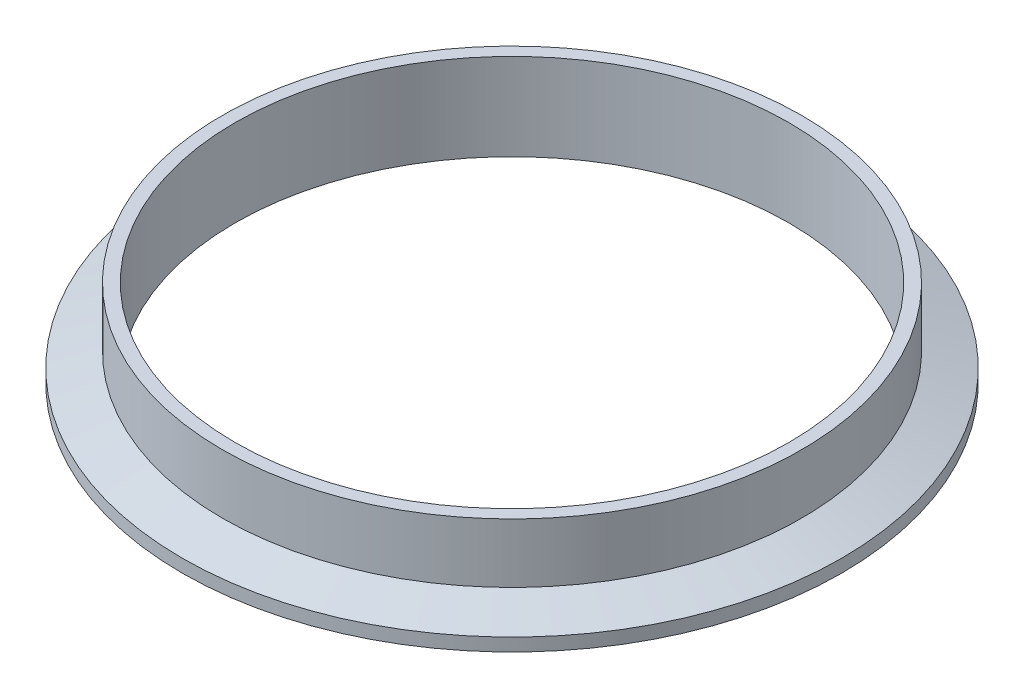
ISO-10303-21;
HEADER;
FILE_DESCRIPTION(('STEP AP214'),'2;1');
FILE_NAME('part.step','',(''),(''),'','','');
FILE_SCHEMA(('AUTOMOTIVE_DESIGN { 1 0 10303 214 1 1 1 1 }'));
ENDSEC;
DATA;
#1=APPLICATION_CONTEXT('core data for automotive mechanical design processes');
#2=APPLICATION_PROTOCOL_DEFINITION('international standard','automotive_design',2000,#1);
#3=PRODUCT_CONTEXT('',#1,'mechanical');
#4=PRODUCT('Part','Part','',(#3));
#5=PRODUCT_RELATED_PRODUCT_CATEGORY('part','',(#4));
#6=PRODUCT_DEFINITION_FORMATION('','',#4);
#7=PRODUCT_DEFINITION_CONTEXT('part definition',#1,'design');
#8=PRODUCT_DEFINITION('design','',#6,#7);
#9=PRODUCT_DEFINITION_SHAPE('','',#8);
#10=(LENGTH_UNIT() NAMED_UNIT(*) SI_UNIT(.MILLI.,.METRE.));
#11=(NAMED_UNIT(*) PLANE_ANGLE_UNIT() SI_UNIT($,.RADIAN.));
#12=(NAMED_UNIT(*) SI_UNIT($,.STERADIAN.) SOLID_ANGLE_UNIT());
#13=UNCERTAINTY_MEASURE_WITH_UNIT(LENGTH_MEASURE(1.E-05),#10,'distance_accuracy_value','');
#14=(GEOMETRIC_REPRESENTATION_CONTEXT(3) GLOBAL_UNCERTAINTY_ASSIGNED_CONTEXT((#13)) GLOBAL_UNIT_ASSIGNED_CONTEXT((#10,
#11,#12)) REPRESENTATION_CONTEXT('',''));
#15=CARTESIAN_POINT('',(0.,0.,0.));
#16=DIRECTION('',(0.,0.,1.));
#17=DIRECTION('',(1.,0.,0.));
#18=AXIS2_PLACEMENT_3D('',#15,#16,#17);
#19=CARTESIAN_POINT('',(0.,0.787399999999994,0.));
#20=DIRECTION('',(0.,-1.,0.));
#21=DIRECTION('',(0.,0.,-1.));
#22=AXIS2_PLACEMENT_3D('',#19,#20,#21);
#23=TOROIDAL_SURFACE('',#22,69.2804084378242,0.787400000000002);
#24=CARTESIAN_POINT('',(0.,0.,0.));
#25=DIRECTION('',(0.,-1.,0.));
#26=DIRECTION('',(0.,0.,-1.));
#27=AXIS2_PLACEMENT_3D('',#24,#25,#26);
#28=CIRCLE('',#27,69.2804084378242);
#29=CARTESIAN_POINT('',(0.,0.,-69.2804084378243));
#30=VERTEX_POINT('',#29);
#31=EDGE_CURVE('E62',#30,#30,#28,.T.);
#32=ORIENTED_EDGE('',*,*,#31,.T.);
#33=EDGE_LOOP('',(#32));
#34=FACE_BOUND('',#33,.T.);
#35=CARTESIAN_POINT('',(0.,0.474458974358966,0.));
#36=DIRECTION('',(0.,-1.,0.));
#37=DIRECTION('',(0.,0.,-1.));
#38=AXIS2_PLACEMENT_3D('',#35,#36,#37);
#39=CIRCLE('',#38,68.5578666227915);
#40=CARTESIAN_POINT('',(0.,0.474458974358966,-68.5578666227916));
#41=VERTEX_POINT('',#40);
#42=EDGE_CURVE('E10',#41,#41,#39,.T.);
#43=ORIENTED_EDGE('',*,*,#42,.F.);
#44=EDGE_LOOP('',(#43));
#45=FACE_BOUND('',#44,.T.);
#46=ADVANCED_FACE('F28',(#34,#45),#23,.T.);
#47=CARTESIAN_POINT('',(0.,0.,0.));
#48=DIRECTION('',(0.,-1.,0.));
#49=DIRECTION('',(0.,0.,-1.));
#50=AXIS2_PLACEMENT_3D('',#47,#48,#49);
#51=TOROIDAL_SURFACE('',#50,67.4624,1.19380000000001);
#52=CARTESIAN_POINT('',(0.,0.474458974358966,0.));
#53=DIRECTION('',(0.,-1.,0.));
#54=DIRECTION('',(0.,0.,-1.));
#55=AXIS2_PLACEMENT_3D('',#52,#53,#54);
#56=CIRCLE('',#55,66.3669333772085);
#57=CARTESIAN_POINT('',(0.,0.474458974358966,-66.3669333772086));
#58=VERTEX_POINT('',#57);
#59=EDGE_CURVE('E34',#58,#58,#56,.T.);
#60=ORIENTED_EDGE('',*,*,#59,.F.);
#61=EDGE_LOOP('',(#60));
#62=FACE_BOUND('',#61,.T.);
#63=ORIENTED_EDGE('',*,*,#42,.T.);
#64=EDGE_LOOP('',(#63));
#65=FACE_BOUND('',#64,.T.);
#66=ADVANCED_FACE('F110',(#62,#65),#51,.F.);
#67=CARTESIAN_POINT('',(0.,0.787399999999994,0.));
#68=DIRECTION('',(0.,-1.,0.));
#69=DIRECTION('',(0.,0.,-1.));
#70=AXIS2_PLACEMENT_3D('',#67,#68,#69);
#71=TOROIDAL_SURFACE('',#70,65.6443915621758,0.78739999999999);
#72=ORIENTED_EDGE('',*,*,#59,.T.);
#73=EDGE_LOOP('',(#72));
#74=FACE_BOUND('',#73,.T.);
#75=CARTESIAN_POINT('',(0.,0.,0.));
#76=DIRECTION('',(0.,-1.,0.));
#77=DIRECTION('',(0.,0.,-1.));
#78=AXIS2_PLACEMENT_3D('',#75,#76,#77);
#79=CIRCLE('',#78,65.6443915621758);
#80=CARTESIAN_POINT('',(0.,0.,-65.6443915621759));
#81=VERTEX_POINT('',#80);
#82=EDGE_CURVE('E38',#81,#81,#79,.T.);
#83=ORIENTED_EDGE('',*,*,#82,.F.);
#84=EDGE_LOOP('',(#83));
#85=FACE_BOUND('',#84,.T.);
#86=ADVANCED_FACE('F106',(#74,#85),#71,.T.);
#87=CARTESIAN_POINT('',(0.,0.,0.));
#88=DIRECTION('',(0.,1.,0.));
#89=DIRECTION('',(0.,0.,1.));
#90=AXIS2_PLACEMENT_3D('',#87,#88,#89);
#91=PLANE('',#90);
#92=CARTESIAN_POINT('',(0.,0.,0.));
#93=DIRECTION('',(0.,-1.,0.));
#94=DIRECTION('',(0.,0.,-1.));
#95=AXIS2_PLACEMENT_3D('',#92,#93,#94);
#96=CIRCLE('',#95,60.7314);
#97=CARTESIAN_POINT('',(0.,0.,-60.7314000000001));
#98=VERTEX_POINT('',#97);
#99=EDGE_CURVE('E42',#98,#98,#96,.T.);
#100=ORIENTED_EDGE('',*,*,#99,.F.);
#101=EDGE_LOOP('',(#100));
#102=FACE_BOUND('',#101,.T.);
#103=ORIENTED_EDGE('',*,*,#82,.T.);
#104=EDGE_LOOP('',(#103));
#105=FACE_BOUND('',#104,.T.);
#106=ADVANCED_FACE('F100',(#102,#105),#91,.F.);
#107=CARTESIAN_POINT('',(0.,0.,0.));
#108=DIRECTION('',(0.,-1.,0.));
#109=DIRECTION('',(0.,0.,-1.));
#110=AXIS2_PLACEMENT_3D('',#107,#108,#109);
#111=CYLINDRICAL_SURFACE('',#110,60.7314);
#112=ORIENTED_EDGE('',*,*,#99,.T.);
#113=EDGE_LOOP('',(#112));
#114=FACE_BOUND('',#113,.T.);
#115=CARTESIAN_POINT('',(0.,19.05,0.));
#116=DIRECTION('',(0.,-1.,0.));
#117=DIRECTION('',(0.,0.,-1.));
#118=AXIS2_PLACEMENT_3D('',#115,#116,#117);
#119=CIRCLE('',#118,60.7314);
#120=CARTESIAN_POINT('',(0.,19.05,-60.7314000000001));
#121=VERTEX_POINT('',#120);
#122=EDGE_CURVE('E47',#121,#121,#119,.T.);
#123=ORIENTED_EDGE('',*,*,#122,.F.);
#124=EDGE_LOOP('',(#123));
#125=FACE_BOUND('',#124,.T.);
#126=ADVANCED_FACE('F95',(#114,#125),#111,.F.);
#127=CARTESIAN_POINT('',(0.,19.05,0.));
#128=DIRECTION('',(0.,-1.,0.));
#129=DIRECTION('',(0.,0.,-1.));
#130=AXIS2_PLACEMENT_3D('',#127,#128,#129);
#131=PLANE('',#130);
#132=CARTESIAN_POINT('',(0.,19.05,0.));
#133=DIRECTION('',(0.,-1.,0.));
#134=DIRECTION('',(0.,0.,-1.));
#135=AXIS2_PLACEMENT_3D('',#132,#133,#134);
#136=CIRCLE('',#135,63.5);
#137=CARTESIAN_POINT('',(0.,19.05,-63.5000000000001));
#138=VERTEX_POINT('',#137);
#139=EDGE_CURVE('E50',#138,#138,#136,.T.);
#140=ORIENTED_EDGE('',*,*,#139,.F.);
#141=EDGE_LOOP('',(#140));
#142=FACE_BOUND('',#141,.T.);
#143=ORIENTED_EDGE('',*,*,#122,.T.);
#144=EDGE_LOOP('',(#143));
#145=FACE_BOUND('',#144,.T.);
#146=ADVANCED_FACE('F89',(#142,#145),#131,.F.);
#147=CARTESIAN_POINT('',(0.,0.,0.));
#148=DIRECTION('',(0.,-1.,0.));
#149=DIRECTION('',(0.,0.,-1.));
#150=AXIS2_PLACEMENT_3D('',#147,#148,#149);
#151=CYLINDRICAL_SURFACE('',#150,63.5);
#152=CARTESIAN_POINT('',(0.,6.04351600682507,0.));
#153=DIRECTION('',(0.,-1.,0.));
#154=DIRECTION('',(0.,0.,-1.));
#155=AXIS2_PLACEMENT_3D('',#152,#153,#154);
#156=CIRCLE('',#155,63.5);
#157=CARTESIAN_POINT('',(0.,6.04351600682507,-63.5000000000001));
#158=VERTEX_POINT('',#157);
#159=EDGE_CURVE('E53',#158,#158,#156,.T.);
#160=ORIENTED_EDGE('',*,*,#159,.F.);
#161=EDGE_LOOP('',(#160));
#162=FACE_BOUND('',#161,.T.);
#163=ORIENTED_EDGE('',*,*,#139,.T.);
#164=EDGE_LOOP('',(#163));
#165=FACE_BOUND('',#164,.T.);
#166=ADVANCED_FACE('F83',(#162,#165),#151,.T.);
#167=CARTESIAN_POINT('',(0.,6.04351600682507,0.));
#168=DIRECTION('',(0.,-1.,0.));
#169=DIRECTION('',(0.,0.,-1.));
#170=AXIS2_PLACEMENT_3D('',#167,#168,#169);
#171=CONICAL_SURFACE('',#170,63.5,1.22173047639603);
#172=CARTESIAN_POINT('',(0.,2.84480000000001,0.));
#173=DIRECTION('',(0.,-1.,0.));
#174=DIRECTION('',(0.,0.,-1.));
#175=AXIS2_PLACEMENT_3D('',#172,#173,#174);
#176=CIRCLE('',#175,72.2884);
#177=CARTESIAN_POINT('',(0.,2.84480000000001,-72.2884000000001));
#178=VERTEX_POINT('',#177);
#179=EDGE_CURVE('E56',#178,#178,#176,.T.);
#180=ORIENTED_EDGE('',*,*,#179,.F.);
#181=EDGE_LOOP('',(#180));
#182=FACE_BOUND('',#181,.T.);
#183=ORIENTED_EDGE('',*,*,#159,.T.);
#184=EDGE_LOOP('',(#183));
#185=FACE_BOUND('',#184,.T.);
#186=ADVANCED_FACE('F77',(#182,#185),#171,.T.);
#187=CARTESIAN_POINT('',(0.,0.,0.));
#188=DIRECTION('',(0.,-1.,0.));
#189=DIRECTION('',(0.,0.,-1.));
#190=AXIS2_PLACEMENT_3D('',#187,#188,#189);
#191=CYLINDRICAL_SURFACE('',#190,72.2884);
#192=CARTESIAN_POINT('',(0.,0.,0.));
#193=DIRECTION('',(0.,-1.,0.));
#194=DIRECTION('',(0.,0.,-1.));
#195=AXIS2_PLACEMENT_3D('',#192,#193,#194);
#196=CIRCLE('',#195,72.2884);
#197=CARTESIAN_POINT('',(0.,0.,-72.2884000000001));
#198=VERTEX_POINT('',#197);
#199=EDGE_CURVE('E59',#198,#198,#196,.T.);
#200=ORIENTED_EDGE('',*,*,#199,.F.);
#201=EDGE_LOOP('',(#200));
#202=FACE_BOUND('',#201,.T.);
#203=ORIENTED_EDGE('',*,*,#179,.T.);
#204=EDGE_LOOP('',(#203));
#205=FACE_BOUND('',#204,.T.);
#206=ADVANCED_FACE('F71',(#202,#205),#191,.T.);
#207=CARTESIAN_POINT('',(0.,0.,0.));
#208=DIRECTION('',(0.,1.,0.));
#209=DIRECTION('',(0.,0.,1.));
#210=AXIS2_PLACEMENT_3D('',#207,#208,#209);
#211=PLANE('',#210);
#212=ORIENTED_EDGE('',*,*,#31,.F.);
#213=EDGE_LOOP('',(#212));
#214=FACE_BOUND('',#213,.T.);
#215=ORIENTED_EDGE('',*,*,#199,.T.);
#216=EDGE_LOOP('',(#215));
#217=FACE_BOUND('',#216,.T.);
#218=ADVANCED_FACE('F68',(#214,#217),#211,.F.);
#219=CLOSED_SHELL('',(#46,#66,#86,#106,#126,#146,#166,#186,#206,#218));
#220=MANIFOLD_SOLID_BREP('B2',#219);
#221=ADVANCED_BREP_SHAPE_REPRESENTATION('',(#18,#220),#14);
#222=SHAPE_DEFINITION_REPRESENTATION(#9,#221);
ENDSEC;
END-ISO-10303-21;
